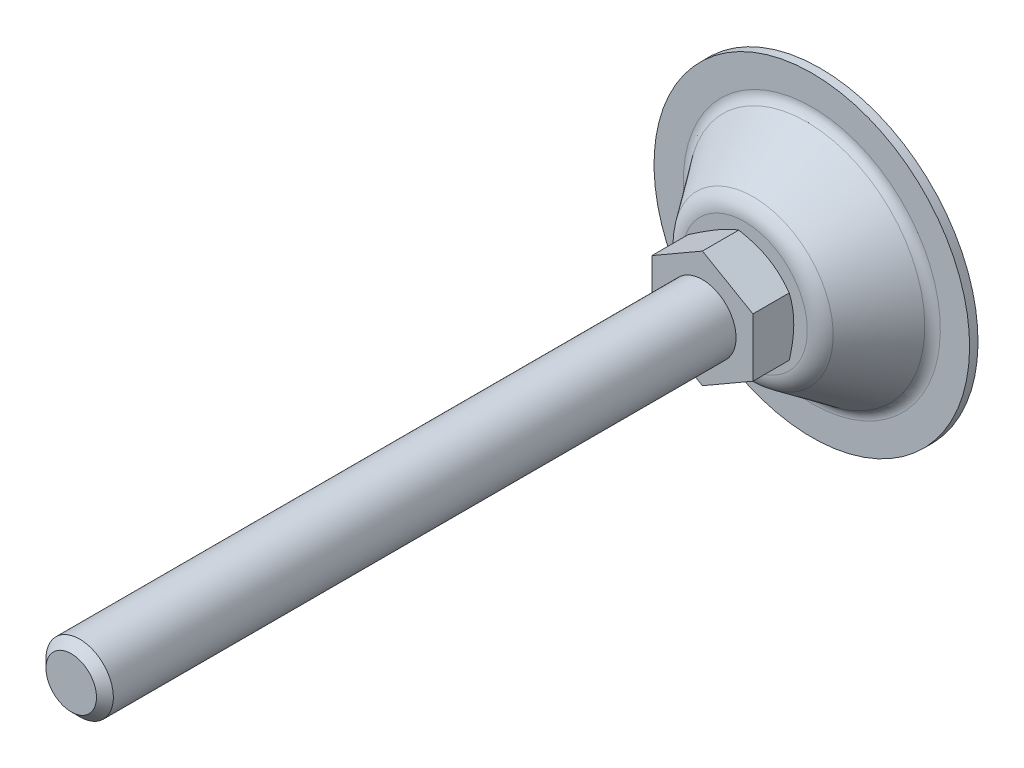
ISO-10303-21;
HEADER;
FILE_DESCRIPTION(('STEP AP214'),'2;1');
FILE_NAME('part.step','',(''),(''),'','','');
FILE_SCHEMA(('AUTOMOTIVE_DESIGN { 1 0 10303 214 1 1 1 1 }'));
ENDSEC;
DATA;
#1=APPLICATION_CONTEXT('core data for automotive mechanical design processes');
#2=APPLICATION_PROTOCOL_DEFINITION('international standard','automotive_design',2000,#1);
#3=PRODUCT_CONTEXT('',#1,'mechanical');
#4=PRODUCT('Part','Part','',(#3));
#5=PRODUCT_RELATED_PRODUCT_CATEGORY('part','',(#4));
#6=PRODUCT_DEFINITION_FORMATION('','',#4);
#7=PRODUCT_DEFINITION_CONTEXT('part definition',#1,'design');
#8=PRODUCT_DEFINITION('design','',#6,#7);
#9=PRODUCT_DEFINITION_SHAPE('','',#8);
#10=(LENGTH_UNIT() NAMED_UNIT(*) SI_UNIT(.MILLI.,.METRE.));
#11=(NAMED_UNIT(*) PLANE_ANGLE_UNIT() SI_UNIT($,.RADIAN.));
#12=(NAMED_UNIT(*) SI_UNIT($,.STERADIAN.) SOLID_ANGLE_UNIT());
#13=UNCERTAINTY_MEASURE_WITH_UNIT(LENGTH_MEASURE(1.E-05),#10,'distance_accuracy_value','');
#14=(GEOMETRIC_REPRESENTATION_CONTEXT(3) GLOBAL_UNCERTAINTY_ASSIGNED_CONTEXT((#13)) GLOBAL_UNIT_ASSIGNED_CONTEXT((#10,
#11,#12)) REPRESENTATION_CONTEXT('',''));
#15=CARTESIAN_POINT('',(0.,0.,0.));
#16=DIRECTION('',(0.,0.,1.));
#17=DIRECTION('',(1.,0.,0.));
#18=AXIS2_PLACEMENT_3D('',#15,#16,#17);
#19=CARTESIAN_POINT('',(0.,0.,28.));
#20=DIRECTION('',(0.,0.,1.));
#21=DIRECTION('',(0.5,-0.866025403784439,0.));
#22=AXIS2_PLACEMENT_3D('',#19,#20,#21);
#23=PLANE('',#22);
#24=DIRECTION('',(0.,1.,0.));
#25=VECTOR('',#24,1.);
#26=CARTESIAN_POINT('',(12.,-6.92820323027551,28.));
#27=LINE('',#26,#25);
#28=CARTESIAN_POINT('',(12.,-6.92820323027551,28.));
#29=VERTEX_POINT('',#28);
#30=CARTESIAN_POINT('',(12.,6.9282032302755,28.));
#31=VERTEX_POINT('',#30);
#32=EDGE_CURVE('E220',#29,#31,#27,.T.);
#33=ORIENTED_EDGE('',*,*,#32,.T.);
#34=DIRECTION('',(-0.866025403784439,0.5,0.));
#35=VECTOR('',#34,1.);
#36=CARTESIAN_POINT('',(12.,6.9282032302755,28.));
#37=LINE('',#36,#35);
#38=CARTESIAN_POINT('',(0.,13.856406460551,28.));
#39=VERTEX_POINT('',#38);
#40=EDGE_CURVE('E361',#31,#39,#37,.T.);
#41=ORIENTED_EDGE('',*,*,#40,.T.);
#42=DIRECTION('',(-0.866025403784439,-0.5,0.));
#43=VECTOR('',#42,1.);
#44=CARTESIAN_POINT('',(0.,13.856406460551,28.));
#45=LINE('',#44,#43);
#46=CARTESIAN_POINT('',(-12.,6.92820323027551,28.));
#47=VERTEX_POINT('',#46);
#48=EDGE_CURVE('E360',#39,#47,#45,.T.);
#49=ORIENTED_EDGE('',*,*,#48,.T.);
#50=DIRECTION('',(0.,-1.,0.));
#51=VECTOR('',#50,1.);
#52=CARTESIAN_POINT('',(-12.,6.92820323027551,28.));
#53=LINE('',#52,#51);
#54=CARTESIAN_POINT('',(-12.,-6.9282032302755,28.));
#55=VERTEX_POINT('',#54);
#56=EDGE_CURVE('E365',#47,#55,#53,.T.);
#57=ORIENTED_EDGE('',*,*,#56,.T.);
#58=DIRECTION('',(0.866025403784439,-0.5,0.));
#59=VECTOR('',#58,1.);
#60=CARTESIAN_POINT('',(-12.,-6.9282032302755,28.));
#61=LINE('',#60,#59);
#62=CARTESIAN_POINT('',(0.,-13.856406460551,28.));
#63=VERTEX_POINT('',#62);
#64=EDGE_CURVE('E367',#55,#63,#61,.T.);
#65=ORIENTED_EDGE('',*,*,#64,.T.);
#66=DIRECTION('',(0.866025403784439,0.5,0.));
#67=VECTOR('',#66,1.);
#68=CARTESIAN_POINT('',(0.,-13.856406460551,28.));
#69=LINE('',#68,#67);
#70=EDGE_CURVE('E37',#63,#29,#69,.T.);
#71=ORIENTED_EDGE('',*,*,#70,.T.);
#72=EDGE_LOOP('',(#33,#41,#49,#57,#65,#71));
#73=FACE_BOUND('',#72,.T.);
#74=CARTESIAN_POINT('',(0.,0.,28.));
#75=DIRECTION('',(0.,0.,1.));
#76=DIRECTION('',(0.5,-0.866025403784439,0.));
#77=AXIS2_PLACEMENT_3D('',#74,#75,#76);
#78=CIRCLE('',#77,8.);
#79=CARTESIAN_POINT('',(4.,-6.92820323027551,28.));
#80=VERTEX_POINT('',#79);
#81=EDGE_CURVE('E224',#80,#80,#78,.T.);
#82=ORIENTED_EDGE('',*,*,#81,.F.);
#83=EDGE_LOOP('',(#82));
#84=FACE_BOUND('',#83,.T.);
#85=ADVANCED_FACE('F14',(#73,#84),#23,.T.);
#86=CARTESIAN_POINT('',(-7.46811554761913,12.9351555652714,18.));
#87=DIRECTION('',(0.,0.,-1.));
#88=DIRECTION('',(-0.5,0.866025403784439,0.));
#89=AXIS2_PLACEMENT_3D('',#86,#87,#88);
#90=PLANE('',#89);
#91=CARTESIAN_POINT('',(-1.37317446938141E-13,2.37840794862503E-13,18.));
#92=DIRECTION('',(0.,0.,1.));
#93=DIRECTION('',(0.5,-0.866025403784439,0.));
#94=AXIS2_PLACEMENT_3D('',#91,#92,#93);
#95=CIRCLE('',#94,14.936231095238);
#96=CARTESIAN_POINT('',(7.46811554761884,-12.9351555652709,18.));
#97=VERTEX_POINT('',#96);
#98=EDGE_CURVE('E111',#97,#97,#95,.T.);
#99=ORIENTED_EDGE('',*,*,#98,.T.);
#100=EDGE_LOOP('',(#99));
#101=FACE_BOUND('',#100,.T.);
#102=CARTESIAN_POINT('',(0.,0.,18.));
#103=DIRECTION('',(0.,0.,-1.));
#104=DIRECTION('',(-0.5,0.866025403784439,0.));
#105=AXIS2_PLACEMENT_3D('',#102,#103,#104);
#106=CIRCLE('',#105,11.5);
#107=CARTESIAN_POINT('',(-5.75,9.95929214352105,18.));
#108=VERTEX_POINT('',#107);
#109=EDGE_CURVE('E84',#108,#108,#106,.T.);
#110=ORIENTED_EDGE('',*,*,#109,.T.);
#111=EDGE_LOOP('',(#110));
#112=FACE_BOUND('',#111,.T.);
#113=ADVANCED_FACE('F195',(#101,#112),#90,.F.);
#114=CARTESIAN_POINT('',(-1.54390389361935E-13,2.67411998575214E-13,4.9999999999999));
#115=DIRECTION('',(0.,0.,1.));
#116=DIRECTION('',(0.5,-0.866025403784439,0.));
#117=AXIS2_PLACEMENT_3D('',#114,#115,#116);
#118=TOROIDAL_SURFACE('',#117,30.5382613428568,3.);
#119=CARTESIAN_POINT('',(-1.55741344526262E-13,2.69751921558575E-13,3.24909185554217));
#120=DIRECTION('',(0.,0.,1.));
#121=DIRECTION('',(0.5,-0.866025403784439,0.));
#122=AXIS2_PLACEMENT_3D('',#119,#120,#121);
#123=CIRCLE('',#122,28.1022152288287);
#124=CARTESIAN_POINT('',(14.0511076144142,-24.3372322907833,3.2490918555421));
#125=VERTEX_POINT('',#124);
#126=EDGE_CURVE('E73',#125,#125,#123,.T.);
#127=ORIENTED_EDGE('',*,*,#126,.F.);
#128=EDGE_LOOP('',(#127));
#129=FACE_BOUND('',#128,.T.);
#130=CARTESIAN_POINT('',(-1.57301461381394E-13,2.72454123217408E-13,1.99999999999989));
#131=DIRECTION('',(0.,0.,1.));
#132=DIRECTION('',(0.5,-0.866025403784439,0.));
#133=AXIS2_PLACEMENT_3D('',#130,#131,#132);
#134=CIRCLE('',#133,30.5382613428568);
#135=CARTESIAN_POINT('',(15.2691306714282,-26.446910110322,1.99999999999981));
#136=VERTEX_POINT('',#135);
#137=EDGE_CURVE('E102',#136,#136,#134,.T.);
#138=ORIENTED_EDGE('',*,*,#137,.T.);
#139=EDGE_LOOP('',(#138));
#140=FACE_BOUND('',#139,.T.);
#141=ADVANCED_FACE('F198',(#129,#140),#118,.F.);
#142=CARTESIAN_POINT('',(-1.55741344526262E-13,2.69751921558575E-13,3.24909185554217));
#143=DIRECTION('',(0.,0.,-1.));
#144=DIRECTION('',(-0.5,0.866025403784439,0.));
#145=AXIS2_PLACEMENT_3D('',#142,#143,#144);
#146=CONICAL_SURFACE('',#145,28.1022152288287,0.623199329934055);
#147=CARTESIAN_POINT('',(-1.39917641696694E-13,2.42344464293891E-13,15.9181802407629));
#148=DIRECTION('',(0.,0.,1.));
#149=DIRECTION('',(0.5,-0.866025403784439,0.));
#150=AXIS2_PLACEMENT_3D('',#147,#148,#149);
#151=CIRCLE('',#150,18.9963079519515);
#152=CARTESIAN_POINT('',(9.49815397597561,-16.4512852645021,15.9181802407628));
#153=VERTEX_POINT('',#152);
#154=EDGE_CURVE('E114',#153,#153,#151,.T.);
#155=ORIENTED_EDGE('',*,*,#154,.F.);
#156=EDGE_LOOP('',(#155));
#157=FACE_BOUND('',#156,.T.);
#158=ORIENTED_EDGE('',*,*,#126,.T.);
#159=EDGE_LOOP('',(#158));
#160=FACE_BOUND('',#159,.T.);
#161=ADVANCED_FACE('F202',(#157,#160),#146,.T.);
#162=CARTESIAN_POINT('',(-1.43982048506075E-13,2.49384223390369E-13,13.));
#163=DIRECTION('',(0.,0.,1.));
#164=DIRECTION('',(0.5,-0.866025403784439,0.));
#165=AXIS2_PLACEMENT_3D('',#162,#163,#164);
#166=TOROIDAL_SURFACE('',#165,14.9362310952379,5.);
#167=ORIENTED_EDGE('',*,*,#98,.F.);
#168=EDGE_LOOP('',(#167));
#169=FACE_BOUND('',#168,.T.);
#170=ORIENTED_EDGE('',*,*,#154,.T.);
#171=EDGE_LOOP('',(#170));
#172=FACE_BOUND('',#171,.T.);
#173=ADVANCED_FACE('F193',(#169,#172),#166,.T.);
#174=CARTESIAN_POINT('',(-18.75,32.4759526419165,0.));
#175=DIRECTION('',(0.,0.,1.));
#176=DIRECTION('',(0.5,-0.866025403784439,0.));
#177=AXIS2_PLACEMENT_3D('',#174,#175,#176);
#178=PLANE('',#177);
#179=CARTESIAN_POINT('',(-1.59799463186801E-13,2.76780789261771E-13,-1.38777878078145E-13));
#180=DIRECTION('',(0.,0.,1.));
#181=DIRECTION('',(0.5,-0.866025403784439,0.));
#182=AXIS2_PLACEMENT_3D('',#179,#180,#181);
#183=CIRCLE('',#182,37.5);
#184=CARTESIAN_POINT('',(18.7499999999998,-32.4759526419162,-2.32452945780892E-13));
#185=VERTEX_POINT('',#184);
#186=EDGE_CURVE('E108',#185,#185,#183,.T.);
#187=ORIENTED_EDGE('',*,*,#186,.F.);
#188=EDGE_LOOP('',(#187));
#189=FACE_BOUND('',#188,.T.);
#190=ADVANCED_FACE('F189',(#189),#178,.F.);
#191=CARTESIAN_POINT('',(0.,0.,129.670029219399));
#192=DIRECTION('',(0.,0.,1.));
#193=DIRECTION('',(0.5,-0.866025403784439,0.));
#194=AXIS2_PLACEMENT_3D('',#191,#192,#193);
#195=CYLINDRICAL_SURFACE('',#194,37.5);
#196=CARTESIAN_POINT('',(-1.57301461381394E-13,2.72454123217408E-13,1.99999999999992));
#197=DIRECTION('',(0.,0.,1.));
#198=DIRECTION('',(0.5,-0.866025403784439,0.));
#199=AXIS2_PLACEMENT_3D('',#196,#197,#198);
#200=CIRCLE('',#199,37.5);
#201=CARTESIAN_POINT('',(18.7499999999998,-32.4759526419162,1.99999999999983));
#202=VERTEX_POINT('',#201);
#203=EDGE_CURVE('E105',#202,#202,#200,.T.);
#204=ORIENTED_EDGE('',*,*,#203,.F.);
#205=EDGE_LOOP('',(#204));
#206=FACE_BOUND('',#205,.T.);
#207=ORIENTED_EDGE('',*,*,#186,.T.);
#208=EDGE_LOOP('',(#207));
#209=FACE_BOUND('',#208,.T.);
#210=ADVANCED_FACE('F185',(#206,#209),#195,.T.);
#211=CARTESIAN_POINT('',(-18.75,32.4759526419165,2.));
#212=DIRECTION('',(0.,0.,-1.));
#213=DIRECTION('',(-0.5,0.866025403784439,0.));
#214=AXIS2_PLACEMENT_3D('',#211,#212,#213);
#215=PLANE('',#214);
#216=ORIENTED_EDGE('',*,*,#137,.F.);
#217=EDGE_LOOP('',(#216));
#218=FACE_BOUND('',#217,.T.);
#219=ORIENTED_EDGE('',*,*,#203,.T.);
#220=EDGE_LOOP('',(#219));
#221=FACE_BOUND('',#220,.T.);
#222=ADVANCED_FACE('F130',(#218,#221),#215,.F.);
#223=CARTESIAN_POINT('',(0.,0.,23.6283876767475));
#224=DIRECTION('',(0.,0.,1.));
#225=DIRECTION('',(0.5,-0.866025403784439,0.));
#226=AXIS2_PLACEMENT_3D('',#223,#224,#225);
#227=CONICAL_SURFACE('',#226,21.2486534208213,1.0471975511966);
#228=ORIENTED_EDGE('',*,*,#109,.F.);
#229=EDGE_LOOP('',(#228));
#230=FACE_BOUND('',#229,.T.);
#231=CARTESIAN_POINT('',(-10.0532557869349,-19.6606563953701,24.1094504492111));
#232=CARTESIAN_POINT('',(-9.82653838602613,-19.5297610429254,23.9825738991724));
#233=CARTESIAN_POINT('',(-9.59955317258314,-19.398711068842,23.856335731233));
#234=CARTESIAN_POINT('',(-9.14499119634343,-19.1362695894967,23.6052809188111));
#235=CARTESIAN_POINT('',(-8.91741442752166,-19.0048780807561,23.4804642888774));
#236=CARTESIAN_POINT('',(-8.23365135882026,-18.6101072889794,23.1083304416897));
#237=CARTESIAN_POINT('',(-7.77650041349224,-18.346171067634,22.8633674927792));
#238=CARTESIAN_POINT('',(-6.85659953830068,-17.8150660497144,22.3798814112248));
#239=CARTESIAN_POINT('',(-6.39383263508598,-17.5478874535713,22.1414012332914));
#240=CARTESIAN_POINT('',(-5.46459534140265,-17.0113920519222,21.6742979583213));
#241=CARTESIAN_POINT('',(-4.9981251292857,-16.7420753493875,21.4456743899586));
#242=CARTESIAN_POINT('',(-4.04609504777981,-16.1924205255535,20.9939474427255));
#243=CARTESIAN_POINT('',(-3.56039382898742,-15.912000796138,20.7712391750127));
#244=CARTESIAN_POINT('',(-2.58328268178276,-15.3478654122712,20.3428555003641));
#245=CARTESIAN_POINT('',(-2.09187211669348,-15.0641493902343,20.137182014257));
#246=CARTESIAN_POINT('',(-1.10351639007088,-14.4935219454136,19.7483225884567));
#247=CARTESIAN_POINT('',(-0.606584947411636,-14.2066184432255,19.565090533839));
#248=CARTESIAN_POINT('',(0.394451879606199,-13.628669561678,19.2270309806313));
#249=CARTESIAN_POINT('',(0.898554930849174,-13.3376255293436,19.072194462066));
#250=CARTESIAN_POINT('',(1.65882416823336,-12.8986838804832,18.8672836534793));
#251=CARTESIAN_POINT('',(1.91226998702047,-12.7523568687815,18.8036673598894));
#252=CARTESIAN_POINT('',(2.42088138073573,-12.4587099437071,18.6863216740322));
#253=CARTESIAN_POINT('',(2.6760469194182,-12.3113900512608,18.6325920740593));
#254=CARTESIAN_POINT('',(3.18791661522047,-12.0158619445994,18.5359727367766));
#255=CARTESIAN_POINT('',(3.44462075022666,-11.8676537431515,18.4930828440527));
#256=CARTESIAN_POINT('',(3.95929088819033,-11.5705088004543,18.4190010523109));
#257=CARTESIAN_POINT('',(4.2172568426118,-11.4215720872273,18.3878087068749));
#258=CARTESIAN_POINT('',(4.73074751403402,-11.1251081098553,18.3381289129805));
#259=CARTESIAN_POINT('',(4.98626060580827,-10.977587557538,18.319482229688));
#260=CARTESIAN_POINT('',(5.49773994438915,-10.6822848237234,18.294677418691));
#261=CARTESIAN_POINT('',(5.75370618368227,-10.534502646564,18.2885190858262));
#262=CARTESIAN_POINT('',(6.26563805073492,-10.2389386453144,18.2888371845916));
#263=CARTESIAN_POINT('',(6.5216036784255,-10.091156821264,18.295313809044));
#264=CARTESIAN_POINT('',(7.03307268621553,-9.79586005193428,18.3207453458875));
#265=CARTESIAN_POINT('',(7.28857604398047,-9.64834511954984,18.3397008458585));
#266=CARTESIAN_POINT('',(7.90442793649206,-9.29278286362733,18.4000305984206));
#267=CARTESIAN_POINT('',(8.26434066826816,-9.08498715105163,18.4474404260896));
#268=CARTESIAN_POINT('',(8.98145632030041,-8.67096023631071,18.5644233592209));
#269=CARTESIAN_POINT('',(9.33865885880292,-8.46472925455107,18.6339995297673));
#270=CARTESIAN_POINT('',(10.0500214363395,-8.0540238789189,18.7928402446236));
#271=CARTESIAN_POINT('',(10.4041788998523,-7.84955097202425,18.8821200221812));
#272=CARTESIAN_POINT('',(11.1089234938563,-7.44266649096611,19.077650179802));
#273=CARTESIAN_POINT('',(11.4595106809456,-7.24025488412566,19.1839002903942));
#274=CARTESIAN_POINT('',(12.1650627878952,-6.83290418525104,19.4133803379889));
#275=CARTESIAN_POINT('',(12.5199465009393,-6.62801197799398,19.5369408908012));
#276=CARTESIAN_POINT('',(13.2262157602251,-6.22024723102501,19.7966751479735));
#277=CARTESIAN_POINT('',(13.5776012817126,-6.01737470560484,19.9328489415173));
#278=CARTESIAN_POINT('',(14.2770536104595,-5.61354571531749,20.2156602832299));
#279=CARTESIAN_POINT('',(14.6251214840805,-5.41258863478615,20.3622943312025));
#280=CARTESIAN_POINT('',(15.318378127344,-5.01233672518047,20.664315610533));
#281=CARTESIAN_POINT('',(15.6635669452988,-4.81304186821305,20.8197026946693));
#282=CARTESIAN_POINT('',(16.5374507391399,-4.30850482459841,21.2238005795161));
#283=CARTESIAN_POINT('',(17.0644049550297,-4.00426766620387,21.477525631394));
#284=CARTESIAN_POINT('',(18.1134107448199,-3.39862389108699,21.9981888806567));
#285=CARTESIAN_POINT('',(18.635461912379,-3.097217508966,22.2651281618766));
#286=CARTESIAN_POINT('',(19.6756923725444,-2.49664017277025,22.8093074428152));
#287=CARTESIAN_POINT('',(20.1938705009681,-2.19746989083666,23.0865504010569));
#288=CARTESIAN_POINT('',(21.226926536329,-1.60103471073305,23.6490491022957));
#289=CARTESIAN_POINT('',(21.7418045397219,-1.30376975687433,23.9343046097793));
#290=CARTESIAN_POINT('',(22.7695382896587,-0.710407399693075,24.5115723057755));
#291=CARTESIAN_POINT('',(23.2823905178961,-0.414312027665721,24.8035928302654));
#292=CARTESIAN_POINT('',(24.3058697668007,0.176593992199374,25.3927886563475));
#293=CARTESIAN_POINT('',(24.8164967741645,0.471404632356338,25.689963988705));
#294=CARTESIAN_POINT('',(25.835813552,1.05990744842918,26.2884658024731));
#295=CARTESIAN_POINT('',(26.3445036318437,1.35359980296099,26.5897915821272));
#296=CARTESIAN_POINT('',(27.3603325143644,1.94008888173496,27.1959115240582));
#297=CARTESIAN_POINT('',(27.8674713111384,2.23288560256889,27.5007056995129));
#298=CARTESIAN_POINT('',(29.2909254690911,3.05471724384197,28.3613531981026));
#299=CARTESIAN_POINT('',(30.2057559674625,3.58289487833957,28.9204806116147));
#300=CARTESIAN_POINT('',(32.0322611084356,4.63742811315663,30.0456673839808));
#301=CARTESIAN_POINT('',(32.9439356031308,5.16378362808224,30.6117270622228));
#302=CARTESIAN_POINT('',(34.7622656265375,6.2135969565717,31.7474746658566));
#303=CARTESIAN_POINT('',(35.6689280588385,6.73705875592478,32.3171478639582));
#304=CARTESIAN_POINT('',(37.0274616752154,7.52140850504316,33.174659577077));
#305=CARTESIAN_POINT('',(37.4800486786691,7.78270973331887,33.4609880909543));
#306=CARTESIAN_POINT('',(38.3847950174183,8.30506527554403,34.0345430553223));
#307=CARTESIAN_POINT('',(38.8369543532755,8.5661195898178,34.3217695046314));
#308=CARTESIAN_POINT('',(39.2889251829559,8.82706506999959,34.6093910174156));
#309=B_SPLINE_CURVE_WITH_KNOTS('',3,(#231,#232,#233,#234,#235,#236,#237,#238,#239,#240,#241,
#242,#243,#244,#245,#246,#247,#248,#249,#250,#251,#252,#253,#254,#255,#256,#257,#258,#259,#260,
#261,#262,#263,#264,#265,#266,#267,#268,#269,#270,#271,#272,#273,#274,#275,#276,#277,#278,#279,
#280,#281,#282,#283,#284,#285,#286,#287,#288,#289,#290,#291,#292,#293,#294,#295,#296,#297,#298,
#299,#300,#301,#302,#303,#304,#305,#306,#307,#308),.UNSPECIFIED.,.F.,.F.,(4,2,2,2,2,2,2,2,2,2,2,
2,2,2,2,2,2,2,2,2,2,2,2,2,2,2,2,2,2,2,2,2,2,2,2,2,2,2,4),(0.,0.872745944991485,1.74550081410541,
3.49127289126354,5.24667070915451,7.00198449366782,8.81209333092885,10.6224059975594,
12.4289339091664,14.2348869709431,15.1332127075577,16.0315195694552,16.929813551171,
17.8280732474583,18.7147052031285,19.6013225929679,20.4879535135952,21.3746261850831,
22.6287917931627,23.88313089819,25.1384431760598,26.3937355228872,27.6775150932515,
28.9613037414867,30.2446648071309,31.5280042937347,33.5055452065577,35.4832485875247,
37.4615242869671,39.439741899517,41.4205425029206,43.4013549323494,45.3818364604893,
47.3623255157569,50.9478944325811,54.5336291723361,58.1092552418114,59.8969559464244,
61.6846542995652),.UNSPECIFIED.);
#310=CARTESIAN_POINT('',(0.,-13.856406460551,19.3604719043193));
#311=VERTEX_POINT('',#310);
#312=CARTESIAN_POINT('',(12.,-6.92820323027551,19.3604719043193));
#313=VERTEX_POINT('',#312);
#314=EDGE_CURVE('E65',#311,#313,#309,.T.);
#315=ORIENTED_EDGE('',*,*,#314,.F.);
#316=CARTESIAN_POINT('',(-12.0002,-6.92808776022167,19.3605385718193));
#317=CARTESIAN_POINT('',(-11.7364142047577,-7.08038456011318,19.2726247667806));
#318=CARTESIAN_POINT('',(-11.4716448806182,-7.2332492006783,19.1887011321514));
#319=CARTESIAN_POINT('',(-10.9399829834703,-7.54020434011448,19.0299413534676));
#320=CARTESIAN_POINT('',(-10.6730897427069,-7.69429522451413,18.9551081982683));
#321=CARTESIAN_POINT('',(-9.86810959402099,-8.15905073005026,18.7456926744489));
#322=CARTESIAN_POINT('',(-9.32684492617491,-8.47155003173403,18.6265783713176));
#323=CARTESIAN_POINT('',(-8.51686717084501,-8.93919090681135,18.4869061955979));
#324=CARTESIAN_POINT('',(-8.25057389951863,-9.09293539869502,18.4471189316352));
#325=CARTESIAN_POINT('',(-7.71675440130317,-9.40113622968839,18.3803985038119));
#326=CARTESIAN_POINT('',(-7.44922815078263,-9.55559258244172,18.3534655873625));
#327=CARTESIAN_POINT('',(-6.91372963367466,-9.86476279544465,18.3131437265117));
#328=CARTESIAN_POINT('',(-6.64575827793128,-10.0194761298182,18.2997386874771));
#329=CARTESIAN_POINT('',(-6.10956726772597,-10.3290461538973,18.2867582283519));
#330=CARTESIAN_POINT('',(-5.84134762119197,-10.4839028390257,18.2871823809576));
#331=CARTESIAN_POINT('',(-5.3399106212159,-10.7734076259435,18.3008951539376));
#332=CARTESIAN_POINT('',(-5.10665750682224,-10.908076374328,18.3125111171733));
#333=CARTESIAN_POINT('',(-4.64068775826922,-11.1771041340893,18.3459831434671));
#334=CARTESIAN_POINT('',(-4.40797116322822,-11.3114631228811,18.367839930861));
#335=CARTESIAN_POINT('',(-3.94320092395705,-11.5797983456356,18.4214125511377));
#336=CARTESIAN_POINT('',(-3.71114798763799,-11.7137741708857,18.4531365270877));
#337=CARTESIAN_POINT('',(-3.24813003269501,-11.9810977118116,18.5258869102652));
#338=CARTESIAN_POINT('',(-3.01716508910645,-12.1144453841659,18.566913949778));
#339=CARTESIAN_POINT('',(-2.31605804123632,-12.5192297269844,18.7049867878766));
#340=CARTESIAN_POINT('',(-1.84794625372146,-12.789494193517,18.8158000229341));
#341=CARTESIAN_POINT('',(-0.918702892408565,-13.3259930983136,19.0673009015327));
#342=CARTESIAN_POINT('',(-0.457559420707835,-13.5922344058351,19.2079294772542));
#343=CARTESIAN_POINT('',(0.000199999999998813,-13.8565219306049,19.3605385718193));
#344=B_SPLINE_CURVE_WITH_KNOTS('',3,(#316,#317,#318,#319,#320,#321,#322,#323,#324,#325,#326,
#327,#328,#329,#330,#331,#332,#333,#334,#335,#336,#337,#338,#339,#340,#341,#342,#343),
.UNSPECIFIED.,.F.,.F.,(4,2,2,2,2,2,2,2,2,2,2,2,2,4),(0.,0.951004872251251,1.90232158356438,
3.80900466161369,4.73894551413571,5.6689042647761,6.59775529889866,7.52657763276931,
8.3351464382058,9.14377244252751,9.95306755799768,10.7624176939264,12.4167102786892,
14.0677556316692),.UNSPECIFIED.);
#345=CARTESIAN_POINT('',(-12.,-6.9282032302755,19.3604719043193));
#346=VERTEX_POINT('',#345);
#347=EDGE_CURVE('E68',#346,#311,#344,.T.);
#348=ORIENTED_EDGE('',*,*,#347,.F.);
#349=CARTESIAN_POINT('',(-12.,6.92843417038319,19.3605385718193));
#350=CARTESIAN_POINT('',(-12.,6.62384057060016,19.2726247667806));
#351=CARTESIAN_POINT('',(-12.,6.31811128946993,19.1887011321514));
#352=CARTESIAN_POINT('',(-12.,5.70420101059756,19.0299413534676));
#353=CARTESIAN_POINT('',(-12.,5.39601924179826,18.9551081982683));
#354=CARTESIAN_POINT('',(-12.,4.466508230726,18.7456926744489));
#355=CARTESIAN_POINT('',(-12.,3.84150962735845,18.6265783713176));
#356=CARTESIAN_POINT('',(-12.,2.9062278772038,18.4869061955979));
#357=CARTESIAN_POINT('',(-12.,2.59873889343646,18.4471189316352));
#358=CARTESIAN_POINT('',(-12.,1.98233723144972,18.3803985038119));
#359=CARTESIAN_POINT('',(-12.,1.67342452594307,18.3534655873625));
#360=CARTESIAN_POINT('',(-12.,1.05508409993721,18.3131437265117));
#361=CARTESIAN_POINT('',(-12.,0.745657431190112,18.2997386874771));
#362=CARTESIAN_POINT('',(-12.,0.126517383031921,18.2867582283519));
#363=CARTESIAN_POINT('',(-12.,-0.183195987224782,18.2871823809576));
#364=CARTESIAN_POINT('',(-12.,-0.762205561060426,18.3008951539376));
#365=CARTESIAN_POINT('',(-12.,-1.03154305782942,18.3125111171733));
#366=CARTESIAN_POINT('',(-12.,-1.56959857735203,18.3459831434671));
#367=CARTESIAN_POINT('',(-12.,-1.83831655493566,18.367839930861));
#368=CARTESIAN_POINT('',(-12.,-2.37498700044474,18.4214125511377));
#369=CARTESIAN_POINT('',(-12.,-2.64293865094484,18.4531365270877));
#370=CARTESIAN_POINT('',(-12.,-3.17758573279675,18.5258869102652));
#371=CARTESIAN_POINT('',(-12.,-3.4442810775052,18.566913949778));
#372=CARTESIAN_POINT('',(-12.,-4.25384976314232,18.7049867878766));
#373=CARTESIAN_POINT('',(-12.,-4.79437869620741,18.8158000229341));
#374=CARTESIAN_POINT('',(-12.,-5.86737650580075,19.0673009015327));
#375=CARTESIAN_POINT('',(-12.,-6.39985912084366,19.2079294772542));
#376=CARTESIAN_POINT('',(-12.,-6.92843417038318,19.3605385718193));
#377=B_SPLINE_CURVE_WITH_KNOTS('',3,(#349,#350,#351,#352,#353,#354,#355,#356,#357,#358,#359,
#360,#361,#362,#363,#364,#365,#366,#367,#368,#369,#370,#371,#372,#373,#374,#375,#376),
.UNSPECIFIED.,.F.,.F.,(4,2,2,2,2,2,2,2,2,2,2,2,2,4),(0.,0.951004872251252,1.90232158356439,
3.80900466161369,4.73894551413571,5.6689042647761,6.59775529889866,7.52657763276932,
8.3351464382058,9.14377244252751,9.95306755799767,10.7624176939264,12.4167102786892,
14.0677556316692),.UNSPECIFIED.);
#378=CARTESIAN_POINT('',(-12.,6.92820323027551,19.3604719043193));
#379=VERTEX_POINT('',#378);
#380=EDGE_CURVE('E83',#379,#346,#377,.T.);
#381=ORIENTED_EDGE('',*,*,#380,.F.);
#382=CARTESIAN_POINT('',(-22.0532557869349,1.12395329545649,24.1094504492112));
#383=CARTESIAN_POINT('',(-21.8265383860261,1.25484864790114,23.9825738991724));
#384=CARTESIAN_POINT('',(-21.5995531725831,1.38589862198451,23.856335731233));
#385=CARTESIAN_POINT('',(-21.1449911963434,1.64834010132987,23.6052809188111));
#386=CARTESIAN_POINT('',(-20.9174144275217,1.77973161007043,23.4804642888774));
#387=CARTESIAN_POINT('',(-20.2336513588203,2.1745024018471,23.1083304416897));
#388=CARTESIAN_POINT('',(-19.7765004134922,2.43843862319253,22.8633674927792));
#389=CARTESIAN_POINT('',(-18.8565995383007,2.96954364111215,22.3798814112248));
#390=CARTESIAN_POINT('',(-18.393832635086,3.23672223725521,22.1414012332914));
#391=CARTESIAN_POINT('',(-17.4645953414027,3.77321763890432,21.6742979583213));
#392=CARTESIAN_POINT('',(-16.9981251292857,4.04253434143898,21.4456743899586));
#393=CARTESIAN_POINT('',(-16.0460950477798,4.59218916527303,20.9939474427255));
#394=CARTESIAN_POINT('',(-15.5603938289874,4.87260889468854,20.7712391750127));
#395=CARTESIAN_POINT('',(-14.5832826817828,5.43674427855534,20.3428555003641));
#396=CARTESIAN_POINT('',(-14.0918721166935,5.72046030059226,20.137182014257));
#397=CARTESIAN_POINT('',(-13.1035163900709,6.29108774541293,19.7483225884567));
#398=CARTESIAN_POINT('',(-12.6065849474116,6.57799124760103,19.565090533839));
#399=CARTESIAN_POINT('',(-11.6055481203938,7.1559401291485,19.2270309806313));
#400=CARTESIAN_POINT('',(-11.1014450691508,7.44698416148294,19.072194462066));
#401=CARTESIAN_POINT('',(-10.3411758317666,7.8859258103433,18.8672836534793));
#402=CARTESIAN_POINT('',(-10.0877300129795,8.03225282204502,18.8036673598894));
#403=CARTESIAN_POINT('',(-9.57911861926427,8.32589974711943,18.6863216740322));
#404=CARTESIAN_POINT('',(-9.3239530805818,8.47321963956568,18.6325920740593));
#405=CARTESIAN_POINT('',(-8.81208338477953,8.76874774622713,18.5359727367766));
#406=CARTESIAN_POINT('',(-8.55537924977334,8.91695594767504,18.4930828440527));
#407=CARTESIAN_POINT('',(-8.04070911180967,9.21410089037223,18.4190010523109));
#408=CARTESIAN_POINT('',(-7.78274315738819,9.36303760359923,18.3878087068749));
#409=CARTESIAN_POINT('',(-7.26925248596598,9.6595015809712,18.3381289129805));
#410=CARTESIAN_POINT('',(-7.01373939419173,9.80702213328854,18.319482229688));
#411=CARTESIAN_POINT('',(-6.50226005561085,10.1023248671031,18.294677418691));
#412=CARTESIAN_POINT('',(-6.24629381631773,10.2501070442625,18.2885190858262));
#413=CARTESIAN_POINT('',(-5.73436194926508,10.5456710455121,18.2888371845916));
#414=CARTESIAN_POINT('',(-5.4783963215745,10.6934528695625,18.295313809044));
#415=CARTESIAN_POINT('',(-4.96692731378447,10.9887496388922,18.3207453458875));
#416=CARTESIAN_POINT('',(-4.71142395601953,11.1362645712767,18.3397008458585));
#417=CARTESIAN_POINT('',(-4.09557206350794,11.4918268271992,18.4000305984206));
#418=CARTESIAN_POINT('',(-3.73565933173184,11.6996225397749,18.4474404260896));
#419=CARTESIAN_POINT('',(-3.01854367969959,12.1136494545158,18.5644233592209));
#420=CARTESIAN_POINT('',(-2.66134114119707,12.3198804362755,18.6339995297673));
#421=CARTESIAN_POINT('',(-1.9499785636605,12.7305858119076,18.7928402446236));
#422=CARTESIAN_POINT('',(-1.59582110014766,12.9350587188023,18.8821200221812));
#423=CARTESIAN_POINT('',(-0.891076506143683,13.3419431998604,19.077650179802));
#424=CARTESIAN_POINT('',(-0.540489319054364,13.5443548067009,19.1839002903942));
#425=CARTESIAN_POINT('',(0.165062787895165,13.9517055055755,19.4133803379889));
#426=CARTESIAN_POINT('',(0.519946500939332,14.1565977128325,19.5369408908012));
#427=CARTESIAN_POINT('',(1.22621576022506,14.5643624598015,19.7966751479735));
#428=CARTESIAN_POINT('',(1.57760128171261,14.7672349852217,19.9328489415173));
#429=CARTESIAN_POINT('',(2.27705361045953,15.171063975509,20.2156602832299));
#430=CARTESIAN_POINT('',(2.62512148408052,15.3720210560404,20.3622943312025));
#431=CARTESIAN_POINT('',(3.31837812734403,15.7722729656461,20.664315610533));
#432=CARTESIAN_POINT('',(3.66356694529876,15.9715678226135,20.8197026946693));
#433=CARTESIAN_POINT('',(4.53745073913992,16.4761048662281,21.2238005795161));
#434=CARTESIAN_POINT('',(5.06440495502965,16.7803420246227,21.477525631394));
#435=CARTESIAN_POINT('',(6.1134107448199,17.3859857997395,21.9981888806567));
#436=CARTESIAN_POINT('',(6.63546191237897,17.6873921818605,22.2651281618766));
#437=CARTESIAN_POINT('',(7.67569237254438,18.2879695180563,22.8093074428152));
#438=CARTESIAN_POINT('',(8.19387050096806,18.5871397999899,23.0865504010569));
#439=CARTESIAN_POINT('',(9.22692653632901,19.1835749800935,23.6490491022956));
#440=CARTESIAN_POINT('',(9.74180453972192,19.4808399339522,23.9343046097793));
#441=CARTESIAN_POINT('',(10.7695382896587,20.0742022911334,24.5115723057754));
#442=CARTESIAN_POINT('',(11.2823905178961,20.3702976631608,24.8035928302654));
#443=CARTESIAN_POINT('',(12.3058697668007,20.9612036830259,25.3927886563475));
#444=CARTESIAN_POINT('',(12.8164967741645,21.2560143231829,25.689963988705));
#445=CARTESIAN_POINT('',(13.835813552,21.8445171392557,26.2884658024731));
#446=CARTESIAN_POINT('',(14.3445036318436,22.1382094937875,26.5897915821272));
#447=CARTESIAN_POINT('',(15.3603325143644,22.7246985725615,27.1959115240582));
#448=CARTESIAN_POINT('',(15.8674713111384,23.0174952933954,27.5007056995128));
#449=CARTESIAN_POINT('',(17.2909254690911,23.8393269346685,28.3613531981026));
#450=CARTESIAN_POINT('',(18.2057559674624,24.3675045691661,28.9204806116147));
#451=CARTESIAN_POINT('',(20.0322611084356,25.4220378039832,30.0456673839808));
#452=CARTESIAN_POINT('',(20.9439356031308,25.9483933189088,30.6117270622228));
#453=CARTESIAN_POINT('',(22.7622656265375,26.9982066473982,31.7474746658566));
#454=CARTESIAN_POINT('',(23.6689280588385,27.5216684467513,32.3171478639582));
#455=CARTESIAN_POINT('',(25.0274616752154,28.3060181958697,33.1746595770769));
#456=CARTESIAN_POINT('',(25.4800486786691,28.5673194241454,33.4609880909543));
#457=CARTESIAN_POINT('',(26.3847950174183,29.0896749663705,34.0345430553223));
#458=CARTESIAN_POINT('',(26.8369543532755,29.3507292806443,34.3217695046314));
#459=CARTESIAN_POINT('',(27.2889251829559,29.6116747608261,34.6093910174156));
#460=B_SPLINE_CURVE_WITH_KNOTS('',3,(#382,#383,#384,#385,#386,#387,#388,#389,#390,#391,#392,
#393,#394,#395,#396,#397,#398,#399,#400,#401,#402,#403,#404,#405,#406,#407,#408,#409,#410,#411,
#412,#413,#414,#415,#416,#417,#418,#419,#420,#421,#422,#423,#424,#425,#426,#427,#428,#429,#430,
#431,#432,#433,#434,#435,#436,#437,#438,#439,#440,#441,#442,#443,#444,#445,#446,#447,#448,#449,
#450,#451,#452,#453,#454,#455,#456,#457,#458,#459),.UNSPECIFIED.,.F.,.F.,(4,2,2,2,2,2,2,2,2,2,2,
2,2,2,2,2,2,2,2,2,2,2,2,2,2,2,2,2,2,2,2,2,2,2,2,2,2,2,4),(0.,0.872745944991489,1.74550081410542,
3.49127289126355,5.24667070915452,7.00198449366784,8.81209333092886,10.6224059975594,
12.4289339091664,14.2348869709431,15.1332127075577,16.0315195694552,16.9298135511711,
17.8280732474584,18.7147052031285,19.6013225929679,20.4879535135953,21.3746261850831,
22.6287917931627,23.88313089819,25.1384431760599,26.3937355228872,27.6775150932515,
28.9613037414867,30.244664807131,31.5280042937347,33.5055452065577,35.4832485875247,
37.4615242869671,39.439741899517,41.4205425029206,43.4013549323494,45.3818364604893,
47.3623255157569,50.9478944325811,54.5336291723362,58.1092552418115,59.8969559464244,
61.6846542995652),.UNSPECIFIED.);
#461=CARTESIAN_POINT('',(0.,13.856406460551,19.3604719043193));
#462=VERTEX_POINT('',#461);
#463=EDGE_CURVE('E152',#462,#379,#460,.F.);
#464=ORIENTED_EDGE('',*,*,#463,.F.);
#465=CARTESIAN_POINT('',(12.0002,6.92808776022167,19.3605385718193));
#466=CARTESIAN_POINT('',(11.7364142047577,7.08038456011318,19.2726247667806));
#467=CARTESIAN_POINT('',(11.4716448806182,7.2332492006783,19.1887011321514));
#468=CARTESIAN_POINT('',(10.9399829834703,7.54020434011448,19.0299413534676));
#469=CARTESIAN_POINT('',(10.6730897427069,7.69429522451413,18.9551081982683));
#470=CARTESIAN_POINT('',(9.86810959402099,8.15905073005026,18.7456926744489));
#471=CARTESIAN_POINT('',(9.32684492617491,8.47155003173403,18.6265783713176));
#472=CARTESIAN_POINT('',(8.51686717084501,8.93919090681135,18.4869061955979));
#473=CARTESIAN_POINT('',(8.25057389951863,9.09293539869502,18.4471189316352));
#474=CARTESIAN_POINT('',(7.71675440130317,9.40113622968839,18.3803985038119));
#475=CARTESIAN_POINT('',(7.44922815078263,9.55559258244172,18.3534655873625));
#476=CARTESIAN_POINT('',(6.91372963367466,9.86476279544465,18.3131437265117));
#477=CARTESIAN_POINT('',(6.64575827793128,10.0194761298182,18.2997386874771));
#478=CARTESIAN_POINT('',(6.10956726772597,10.3290461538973,18.2867582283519));
#479=CARTESIAN_POINT('',(5.84134762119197,10.4839028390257,18.2871823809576));
#480=CARTESIAN_POINT('',(5.3399106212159,10.7734076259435,18.3008951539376));
#481=CARTESIAN_POINT('',(5.10665750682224,10.908076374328,18.3125111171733));
#482=CARTESIAN_POINT('',(4.64068775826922,11.1771041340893,18.3459831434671));
#483=CARTESIAN_POINT('',(4.40797116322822,11.3114631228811,18.367839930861));
#484=CARTESIAN_POINT('',(3.94320092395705,11.5797983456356,18.4214125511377));
#485=CARTESIAN_POINT('',(3.71114798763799,11.7137741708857,18.4531365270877));
#486=CARTESIAN_POINT('',(3.24813003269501,11.9810977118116,18.5258869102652));
#487=CARTESIAN_POINT('',(3.01716508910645,12.1144453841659,18.566913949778));
#488=CARTESIAN_POINT('',(2.31605804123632,12.5192297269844,18.7049867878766));
#489=CARTESIAN_POINT('',(1.84794625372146,12.789494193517,18.8158000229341));
#490=CARTESIAN_POINT('',(0.918702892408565,13.3259930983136,19.0673009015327));
#491=CARTESIAN_POINT('',(0.457559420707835,13.5922344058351,19.2079294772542));
#492=CARTESIAN_POINT('',(-0.000199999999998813,13.8565219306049,19.3605385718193));
#493=B_SPLINE_CURVE_WITH_KNOTS('',3,(#465,#466,#467,#468,#469,#470,#471,#472,#473,#474,#475,
#476,#477,#478,#479,#480,#481,#482,#483,#484,#485,#486,#487,#488,#489,#490,#491,#492),
.UNSPECIFIED.,.F.,.F.,(4,2,2,2,2,2,2,2,2,2,2,2,2,4),(0.,0.951004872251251,1.90232158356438,
3.80900466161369,4.73894551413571,5.6689042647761,6.59775529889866,7.52657763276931,
8.3351464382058,9.14377244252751,9.95306755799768,10.7624176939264,12.4167102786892,
14.0677556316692),.UNSPECIFIED.);
#494=CARTESIAN_POINT('',(12.,6.9282032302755,19.3604719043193));
#495=VERTEX_POINT('',#494);
#496=EDGE_CURVE('E159',#495,#462,#493,.T.);
#497=ORIENTED_EDGE('',*,*,#496,.F.);
#498=CARTESIAN_POINT('',(12.,-6.92843417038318,19.3605385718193));
#499=CARTESIAN_POINT('',(12.,-6.62384057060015,19.2726247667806));
#500=CARTESIAN_POINT('',(12.,-6.31811128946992,19.1887011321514));
#501=CARTESIAN_POINT('',(12.,-5.70420101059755,19.0299413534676));
#502=CARTESIAN_POINT('',(12.,-5.39601924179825,18.9551081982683));
#503=CARTESIAN_POINT('',(12.,-4.46650823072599,18.7456926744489));
#504=CARTESIAN_POINT('',(12.,-3.84150962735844,18.6265783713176));
#505=CARTESIAN_POINT('',(12.,-2.9062278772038,18.4869061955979));
#506=CARTESIAN_POINT('',(12.,-2.59873889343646,18.4471189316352));
#507=CARTESIAN_POINT('',(12.,-1.98233723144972,18.3803985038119));
#508=CARTESIAN_POINT('',(12.,-1.67342452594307,18.3534655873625));
#509=CARTESIAN_POINT('',(12.,-1.05508409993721,18.3131437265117));
#510=CARTESIAN_POINT('',(12.,-0.745657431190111,18.2997386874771));
#511=CARTESIAN_POINT('',(12.,-0.12651738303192,18.2867582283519));
#512=CARTESIAN_POINT('',(12.,0.183195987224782,18.2871823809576));
#513=CARTESIAN_POINT('',(12.,0.762205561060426,18.3008951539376));
#514=CARTESIAN_POINT('',(12.,1.03154305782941,18.3125111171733));
#515=CARTESIAN_POINT('',(12.,1.56959857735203,18.3459831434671));
#516=CARTESIAN_POINT('',(12.,1.83831655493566,18.367839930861));
#517=CARTESIAN_POINT('',(12.,2.37498700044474,18.4214125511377));
#518=CARTESIAN_POINT('',(12.,2.64293865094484,18.4531365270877));
#519=CARTESIAN_POINT('',(12.,3.17758573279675,18.5258869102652));
#520=CARTESIAN_POINT('',(12.,3.4442810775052,18.566913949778));
#521=CARTESIAN_POINT('',(12.,4.25384976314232,18.7049867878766));
#522=CARTESIAN_POINT('',(12.,4.79437869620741,18.8158000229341));
#523=CARTESIAN_POINT('',(12.,5.86737650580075,19.0673009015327));
#524=CARTESIAN_POINT('',(12.,6.39985912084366,19.2079294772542));
#525=CARTESIAN_POINT('',(12.,6.92843417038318,19.3605385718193));
#526=B_SPLINE_CURVE_WITH_KNOTS('',3,(#498,#499,#500,#501,#502,#503,#504,#505,#506,#507,#508,
#509,#510,#511,#512,#513,#514,#515,#516,#517,#518,#519,#520,#521,#522,#523,#524,#525),
.UNSPECIFIED.,.F.,.F.,(4,2,2,2,2,2,2,2,2,2,2,2,2,4),(0.,0.951004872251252,1.90232158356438,
3.80900466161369,4.7389455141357,5.66890426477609,6.59775529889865,7.52657763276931,
8.33514643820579,9.1437724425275,9.95306755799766,10.7624176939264,12.4167102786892,
14.0677556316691),.UNSPECIFIED.);
#527=EDGE_CURVE('E29',#313,#495,#526,.T.);
#528=ORIENTED_EDGE('',*,*,#527,.F.);
#529=EDGE_LOOP('',(#315,#348,#381,#464,#497,#528));
#530=FACE_BOUND('',#529,.T.);
#531=ADVANCED_FACE('F67',(#230,#530),#227,.T.);
#532=CARTESIAN_POINT('',(0.,-13.856406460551,28.));
#533=DIRECTION('',(-0.5,0.866025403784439,0.));
#534=DIRECTION('',(0.,0.,1.));
#535=AXIS2_PLACEMENT_3D('',#532,#533,#534);
#536=PLANE('',#535);
#537=DIRECTION('',(0.,0.,-1.));
#538=VECTOR('',#537,1.);
#539=CARTESIAN_POINT('',(0.,-13.856406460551,28.));
#540=LINE('',#539,#538);
#541=EDGE_CURVE('E80',#63,#311,#540,.T.);
#542=ORIENTED_EDGE('',*,*,#541,.T.);
#543=ORIENTED_EDGE('',*,*,#314,.T.);
#544=DIRECTION('',(0.,0.,-1.));
#545=VECTOR('',#544,1.);
#546=CARTESIAN_POINT('',(12.,-6.92820323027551,28.));
#547=LINE('',#546,#545);
#548=EDGE_CURVE('E87',#29,#313,#547,.T.);
#549=ORIENTED_EDGE('',*,*,#548,.F.);
#550=ORIENTED_EDGE('',*,*,#70,.F.);
#551=EDGE_LOOP('',(#542,#543,#549,#550));
#552=FACE_BOUND('',#551,.T.);
#553=ADVANCED_FACE('F86',(#552),#536,.F.);
#554=CARTESIAN_POINT('',(-12.,-6.9282032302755,28.));
#555=DIRECTION('',(0.5,0.866025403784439,0.));
#556=DIRECTION('',(-0.866025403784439,0.5,0.));
#557=AXIS2_PLACEMENT_3D('',#554,#555,#556);
#558=PLANE('',#557);
#559=DIRECTION('',(0.,0.,-1.));
#560=VECTOR('',#559,1.);
#561=CARTESIAN_POINT('',(-12.,-6.9282032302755,28.));
#562=LINE('',#561,#560);
#563=EDGE_CURVE('E82',#55,#346,#562,.T.);
#564=ORIENTED_EDGE('',*,*,#563,.T.);
#565=ORIENTED_EDGE('',*,*,#347,.T.);
#566=ORIENTED_EDGE('',*,*,#541,.F.);
#567=ORIENTED_EDGE('',*,*,#64,.F.);
#568=EDGE_LOOP('',(#564,#565,#566,#567));
#569=FACE_BOUND('',#568,.T.);
#570=ADVANCED_FACE('F78',(#569),#558,.F.);
#571=CARTESIAN_POINT('',(-12.,6.92820323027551,28.));
#572=DIRECTION('',(1.,0.,0.));
#573=DIRECTION('',(0.,1.,0.));
#574=AXIS2_PLACEMENT_3D('',#571,#572,#573);
#575=PLANE('',#574);
#576=DIRECTION('',(0.,0.,-1.));
#577=VECTOR('',#576,1.);
#578=CARTESIAN_POINT('',(-12.,6.92820323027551,28.));
#579=LINE('',#578,#577);
#580=EDGE_CURVE('E89',#47,#379,#579,.T.);
#581=ORIENTED_EDGE('',*,*,#580,.T.);
#582=ORIENTED_EDGE('',*,*,#380,.T.);
#583=ORIENTED_EDGE('',*,*,#563,.F.);
#584=ORIENTED_EDGE('',*,*,#56,.F.);
#585=EDGE_LOOP('',(#581,#582,#583,#584));
#586=FACE_BOUND('',#585,.T.);
#587=ADVANCED_FACE('F338',(#586),#575,.F.);
#588=CARTESIAN_POINT('',(0.,13.856406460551,28.));
#589=DIRECTION('',(0.5,-0.866025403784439,0.));
#590=DIRECTION('',(0.,0.,-1.));
#591=AXIS2_PLACEMENT_3D('',#588,#589,#590);
#592=PLANE('',#591);
#593=DIRECTION('',(0.,0.,-1.));
#594=VECTOR('',#593,1.);
#595=CARTESIAN_POINT('',(0.,13.856406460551,28.));
#596=LINE('',#595,#594);
#597=EDGE_CURVE('E96',#39,#462,#596,.T.);
#598=ORIENTED_EDGE('',*,*,#597,.T.);
#599=ORIENTED_EDGE('',*,*,#463,.T.);
#600=ORIENTED_EDGE('',*,*,#580,.F.);
#601=ORIENTED_EDGE('',*,*,#48,.F.);
#602=EDGE_LOOP('',(#598,#599,#600,#601));
#603=FACE_BOUND('',#602,.T.);
#604=ADVANCED_FACE('F176',(#603),#592,.F.);
#605=CARTESIAN_POINT('',(12.,6.9282032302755,28.));
#606=DIRECTION('',(-0.5,-0.866025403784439,0.));
#607=DIRECTION('',(0.866025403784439,-0.5,0.));
#608=AXIS2_PLACEMENT_3D('',#605,#606,#607);
#609=PLANE('',#608);
#610=DIRECTION('',(0.,0.,-1.));
#611=VECTOR('',#610,1.);
#612=CARTESIAN_POINT('',(12.,6.9282032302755,28.));
#613=LINE('',#612,#611);
#614=EDGE_CURVE('E99',#31,#495,#613,.T.);
#615=ORIENTED_EDGE('',*,*,#614,.T.);
#616=ORIENTED_EDGE('',*,*,#496,.T.);
#617=ORIENTED_EDGE('',*,*,#597,.F.);
#618=ORIENTED_EDGE('',*,*,#40,.F.);
#619=EDGE_LOOP('',(#615,#616,#617,#618));
#620=FACE_BOUND('',#619,.T.);
#621=ADVANCED_FACE('F172',(#620),#609,.F.);
#622=CARTESIAN_POINT('',(12.,-6.92820323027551,28.));
#623=DIRECTION('',(-1.,0.,0.));
#624=DIRECTION('',(0.,-1.,0.));
#625=AXIS2_PLACEMENT_3D('',#622,#623,#624);
#626=PLANE('',#625);
#627=ORIENTED_EDGE('',*,*,#548,.T.);
#628=ORIENTED_EDGE('',*,*,#527,.T.);
#629=ORIENTED_EDGE('',*,*,#614,.F.);
#630=ORIENTED_EDGE('',*,*,#32,.F.);
#631=EDGE_LOOP('',(#627,#628,#629,#630));
#632=FACE_BOUND('',#631,.T.);
#633=ADVANCED_FACE('F175',(#632),#626,.F.);
#634=CARTESIAN_POINT('',(0.,0.,178.));
#635=DIRECTION('',(0.,0.,-1.));
#636=DIRECTION('',(-0.5,0.866025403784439,0.));
#637=AXIS2_PLACEMENT_3D('',#634,#635,#636);
#638=CYLINDRICAL_SURFACE('',#637,8.);
#639=CARTESIAN_POINT('',(0.,0.,176.));
#640=DIRECTION('',(0.,0.,1.));
#641=DIRECTION('',(0.5,-0.866025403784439,0.));
#642=AXIS2_PLACEMENT_3D('',#639,#640,#641);
#643=CIRCLE('',#642,8.);
#644=CARTESIAN_POINT('',(4.,-6.92820323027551,176.));
#645=VERTEX_POINT('',#644);
#646=EDGE_CURVE('E9',#645,#645,#643,.F.);
#647=ORIENTED_EDGE('',*,*,#646,.T.);
#648=EDGE_LOOP('',(#647));
#649=FACE_BOUND('',#648,.T.);
#650=ORIENTED_EDGE('',*,*,#81,.T.);
#651=EDGE_LOOP('',(#650));
#652=FACE_BOUND('',#651,.T.);
#653=ADVANCED_FACE('F132',(#649,#652),#638,.T.);
#654=CARTESIAN_POINT('',(0.,0.,178.));
#655=DIRECTION('',(0.,0.,1.));
#656=DIRECTION('',(0.5,-0.866025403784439,0.));
#657=AXIS2_PLACEMENT_3D('',#654,#655,#656);
#658=PLANE('',#657);
#659=CARTESIAN_POINT('',(0.,0.,178.));
#660=DIRECTION('',(0.,0.,1.));
#661=DIRECTION('',(0.5,-0.866025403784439,0.));
#662=AXIS2_PLACEMENT_3D('',#659,#660,#661);
#663=CIRCLE('',#662,6.);
#664=CARTESIAN_POINT('',(3.,-5.19615242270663,178.));
#665=VERTEX_POINT('',#664);
#666=EDGE_CURVE('E22',#665,#665,#663,.T.);
#667=ORIENTED_EDGE('',*,*,#666,.T.);
#668=EDGE_LOOP('',(#667));
#669=FACE_BOUND('',#668,.T.);
#670=ADVANCED_FACE('F231',(#669),#658,.T.);
#671=CARTESIAN_POINT('',(0.,0.,178.));
#672=DIRECTION('',(0.,0.,-1.));
#673=DIRECTION('',(-0.5,0.866025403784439,0.));
#674=AXIS2_PLACEMENT_3D('',#671,#672,#673);
#675=CONICAL_SURFACE('',#674,6.,0.785398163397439);
#676=ORIENTED_EDGE('',*,*,#646,.F.);
#677=EDGE_LOOP('',(#676));
#678=FACE_BOUND('',#677,.T.);
#679=ORIENTED_EDGE('',*,*,#666,.F.);
#680=EDGE_LOOP('',(#679));
#681=FACE_BOUND('',#680,.T.);
#682=ADVANCED_FACE('F16',(#678,#681),#675,.T.);
#683=CLOSED_SHELL('',(#85,#113,#141,#161,#173,#190,#210,#222,#531,#553,#570,#587,#604,#621,#633,
#653,#670,#682));
#684=MANIFOLD_SOLID_BREP('B1',#683);
#685=ADVANCED_BREP_SHAPE_REPRESENTATION('',(#18,#684),#14);
#686=SHAPE_DEFINITION_REPRESENTATION(#9,#685);
ENDSEC;
END-ISO-10303-21;
